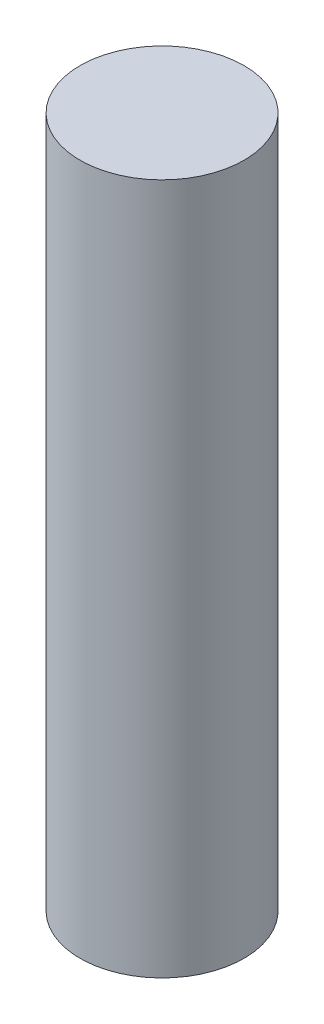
ISO-10303-21;
HEADER;
FILE_DESCRIPTION(('STEP AP214'),'2;1');
FILE_NAME('part.step','',(''),(''),'','','');
FILE_SCHEMA(('AUTOMOTIVE_DESIGN { 1 0 10303 214 1 1 1 1 }'));
ENDSEC;
DATA;
#1=APPLICATION_CONTEXT('core data for automotive mechanical design processes');
#2=APPLICATION_PROTOCOL_DEFINITION('international standard','automotive_design',2000,#1);
#3=PRODUCT_CONTEXT('',#1,'mechanical');
#4=PRODUCT('Part','Part','',(#3));
#5=PRODUCT_RELATED_PRODUCT_CATEGORY('part','',(#4));
#6=PRODUCT_DEFINITION_FORMATION('','',#4);
#7=PRODUCT_DEFINITION_CONTEXT('part definition',#1,'design');
#8=PRODUCT_DEFINITION('design','',#6,#7);
#9=PRODUCT_DEFINITION_SHAPE('','',#8);
#10=(LENGTH_UNIT() NAMED_UNIT(*) SI_UNIT(.MILLI.,.METRE.));
#11=(NAMED_UNIT(*) PLANE_ANGLE_UNIT() SI_UNIT($,.RADIAN.));
#12=(NAMED_UNIT(*) SI_UNIT($,.STERADIAN.) SOLID_ANGLE_UNIT());
#13=UNCERTAINTY_MEASURE_WITH_UNIT(LENGTH_MEASURE(1.E-05),#10,'distance_accuracy_value','');
#14=(GEOMETRIC_REPRESENTATION_CONTEXT(3) GLOBAL_UNCERTAINTY_ASSIGNED_CONTEXT((#13)) GLOBAL_UNIT_ASSIGNED_CONTEXT((#10,
#11,#12)) REPRESENTATION_CONTEXT('',''));
#15=CARTESIAN_POINT('',(0.,0.,0.));
#16=DIRECTION('',(0.,0.,1.));
#17=DIRECTION('',(1.,0.,0.));
#18=AXIS2_PLACEMENT_3D('',#15,#16,#17);
#19=CARTESIAN_POINT('',(0.,12.64,0.));
#20=DIRECTION('',(0.,1.,0.));
#21=DIRECTION('',(0.,0.,1.));
#22=AXIS2_PLACEMENT_3D('',#19,#20,#21);
#23=PLANE('',#22);
#24=CARTESIAN_POINT('',(0.,12.64,0.));
#25=DIRECTION('',(0.,-1.,0.));
#26=DIRECTION('',(0.,0.,-1.));
#27=AXIS2_PLACEMENT_3D('',#24,#25,#26);
#28=CIRCLE('',#27,1.5);
#29=CARTESIAN_POINT('',(0.,12.64,-1.5));
#30=VERTEX_POINT('',#29);
#31=EDGE_CURVE('E10',#30,#30,#28,.T.);
#32=ORIENTED_EDGE('',*,*,#31,.F.);
#33=EDGE_LOOP('',(#32));
#34=FACE_BOUND('',#33,.T.);
#35=ADVANCED_FACE('F32',(#34),#23,.T.);
#36=CARTESIAN_POINT('',(0.,0.,0.));
#37=DIRECTION('',(0.,-1.,0.));
#38=DIRECTION('',(0.,0.,-1.));
#39=AXIS2_PLACEMENT_3D('',#36,#37,#38);
#40=CYLINDRICAL_SURFACE('',#39,1.5);
#41=ORIENTED_EDGE('',*,*,#31,.T.);
#42=EDGE_LOOP('',(#41));
#43=FACE_BOUND('',#42,.T.);
#44=CARTESIAN_POINT('',(0.,0.,0.));
#45=DIRECTION('',(0.,-1.,0.));
#46=DIRECTION('',(0.,0.,-1.));
#47=AXIS2_PLACEMENT_3D('',#44,#45,#46);
#48=CIRCLE('',#47,1.5);
#49=CARTESIAN_POINT('',(0.,0.,-1.5));
#50=VERTEX_POINT('',#49);
#51=EDGE_CURVE('E38',#50,#50,#48,.T.);
#52=ORIENTED_EDGE('',*,*,#51,.F.);
#53=EDGE_LOOP('',(#52));
#54=FACE_BOUND('',#53,.T.);
#55=ADVANCED_FACE('F46',(#43,#54),#40,.T.);
#56=CARTESIAN_POINT('',(1.5,0.,0.));
#57=DIRECTION('',(0.,-1.,0.));
#58=DIRECTION('',(0.,0.,-1.));
#59=AXIS2_PLACEMENT_3D('',#56,#57,#58);
#60=PLANE('',#59);
#61=ORIENTED_EDGE('',*,*,#51,.T.);
#62=EDGE_LOOP('',(#61));
#63=FACE_BOUND('',#62,.T.);
#64=ADVANCED_FACE('F44',(#63),#60,.T.);
#65=CLOSED_SHELL('',(#35,#55,#64));
#66=MANIFOLD_SOLID_BREP('B2',#65);
#67=ADVANCED_BREP_SHAPE_REPRESENTATION('',(#18,#66),#14);
#68=SHAPE_DEFINITION_REPRESENTATION(#9,#67);
ENDSEC;
END-ISO-10303-21;
